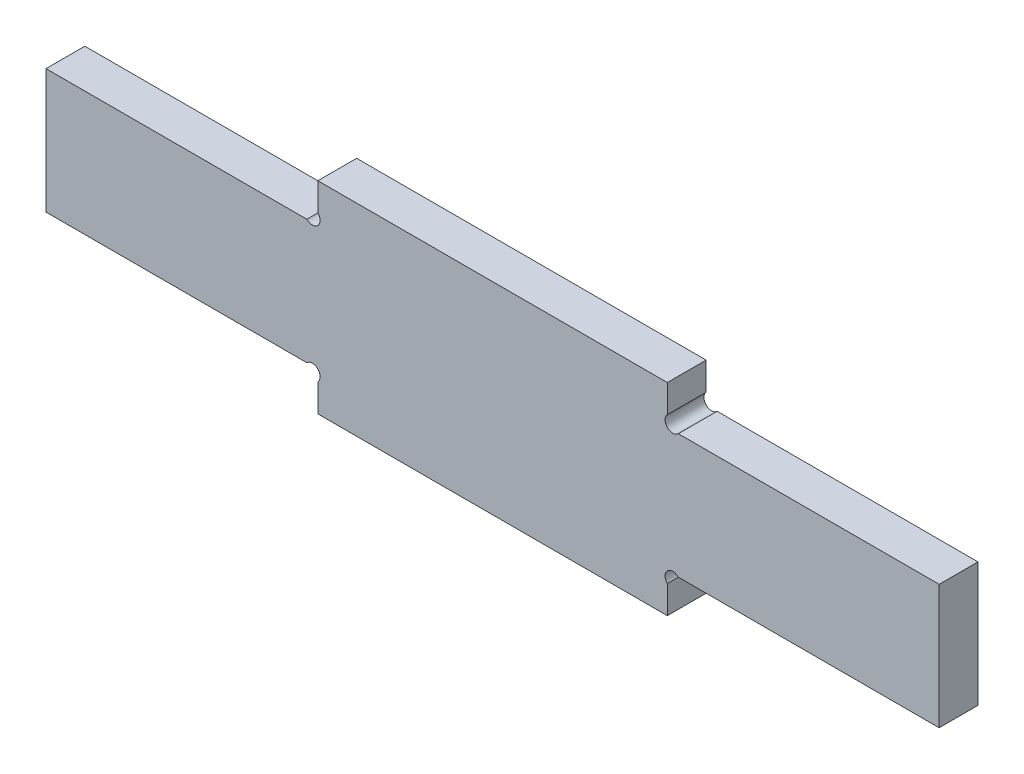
from build123d import *

# Parameters (mm, degrees)
ESQUISSE1_W             = 57.5
ESQUISSE1_H             = 26
BOSS_EXTRU_1_DEPTH      = 5
ENL_V_MAT_EXTRU_1_REACH = 65.303
ESQUISSE3_W             = 35
ESQUISSE3_H             = 5
ENL_V_START             = -5
ESQUISSE4_R             = 1
ENL_V_MAT_EXTRU_2_DEPTH = 5


with BuildPart() as part:
    # Esquisse1 → Boss.-Extru.1 (new body)
    with BuildSketch(Plane.XY):
        with Locations((28.75, 13)):
            Rectangle(ESQUISSE1_W, ESQUISSE1_H)
    boss_extru_1 = extrude(amount=BOSS_EXTRU_1_DEPTH)

    # Esquisse3 → Enl_v. mat.-Extru.1 (cut, up to next)
    with BuildSketch(Plane.XY.offset(5), mode=Mode.PRIVATE) as enl_v_mat_extru_1_sk1:
        with Locations((17.5, 23.5)):
            Rectangle(ESQUISSE3_W, ESQUISSE3_H)
    enl_v_mat_extru_1_tool1 = extrude(enl_v_mat_extru_1_sk1.sketch, amount=-ENL_V_MAT_EXTRU_1_REACH, mode=Mode.PRIVATE) & part.part
    # Esquisse3 → Enl_v. mat.-Extru.1 (cut, up to next)
    with BuildSketch(Plane.XY.offset(5), mode=Mode.PRIVATE) as enl_v_mat_extru_1_sk2:
        with Locations((17.5, 2.5)):
            Rectangle(ESQUISSE3_W, ESQUISSE3_H)
    enl_v_mat_extru_1_tool2 = extrude(enl_v_mat_extru_1_sk2.sketch, amount=-ENL_V_MAT_EXTRU_1_REACH, mode=Mode.PRIVATE) & part.part
    enl_v_mat_extru_1_1 = enl_v_mat_extru_1_tool1.solids().sort_by_distance((17.5, 23.5, 5))[0]
    add(enl_v_mat_extru_1_1, mode=Mode.SUBTRACT)
    enl_v_mat_extru_1_2 = enl_v_mat_extru_1_tool2.solids().sort_by_distance((17.5, 2.5, 5))[0]
    add(enl_v_mat_extru_1_2, mode=Mode.SUBTRACT)
    enl_v_mat_extru_1 = enl_v_mat_extru_1_1 + enl_v_mat_extru_1_2  # Enl_v. mat.-Extru.1 as one shape, for the pattern or mirror that repeats it

    # Esquisse4 → Enl_v. mat.-Extru.2 (cut)
    with BuildSketch(Plane.XY.offset(5).offset(ENL_V_START)):
        with Locations((34.292893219, 21.707106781)):
            Circle(ESQUISSE4_R)
        with Locations((34.292893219, 4.292893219)):
            Circle(ESQUISSE4_R)
    enl_v_mat_extru_2 = extrude(amount=ENL_V_MAT_EXTRU_2_DEPTH, mode=Mode.SUBTRACT)

    # Sym_trie1: Boss.-Extru.1, Enl_v. mat.-Extru.1, Enl_v. mat.-Extru.2 across plane
    add(boss_extru_1.mirror(Plane(origin=(57.5, 0, 5), x_dir=(0, 0, 1), z_dir=(-1, 0, 0))))
    add(enl_v_mat_extru_1.mirror(Plane(origin=(57.5, 0, 5), x_dir=(0, 0, 1), z_dir=(-1, 0, 0))), mode=Mode.SUBTRACT)
    add(enl_v_mat_extru_2.mirror(Plane(origin=(57.5, 0, 5), x_dir=(0, 0, 1), z_dir=(-1, 0, 0))), mode=Mode.SUBTRACT)


solid = part.part
